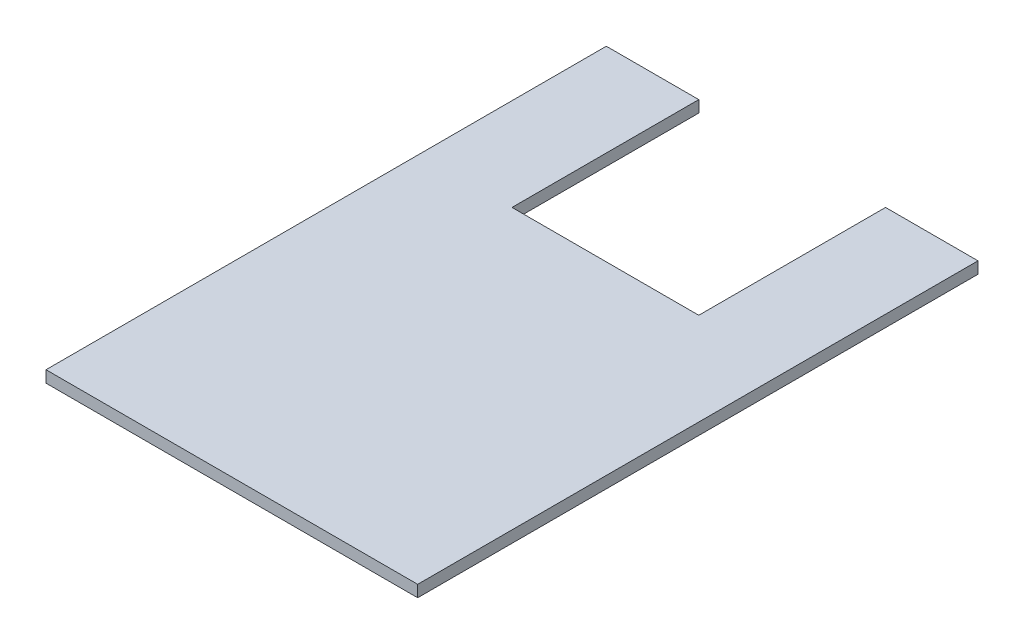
ISO-10303-21;
HEADER;
FILE_DESCRIPTION(('STEP AP214'),'2;1');
FILE_NAME('part.step','',(''),(''),'','','');
FILE_SCHEMA(('AUTOMOTIVE_DESIGN { 1 0 10303 214 1 1 1 1 }'));
ENDSEC;
DATA;
#1=APPLICATION_CONTEXT('core data for automotive mechanical design processes');
#2=APPLICATION_PROTOCOL_DEFINITION('international standard','automotive_design',2000,#1);
#3=PRODUCT_CONTEXT('',#1,'mechanical');
#4=PRODUCT('Part','Part','',(#3));
#5=PRODUCT_RELATED_PRODUCT_CATEGORY('part','',(#4));
#6=PRODUCT_DEFINITION_FORMATION('','',#4);
#7=PRODUCT_DEFINITION_CONTEXT('part definition',#1,'design');
#8=PRODUCT_DEFINITION('design','',#6,#7);
#9=PRODUCT_DEFINITION_SHAPE('','',#8);
#10=(LENGTH_UNIT() NAMED_UNIT(*) SI_UNIT(.MILLI.,.METRE.));
#11=(NAMED_UNIT(*) PLANE_ANGLE_UNIT() SI_UNIT($,.RADIAN.));
#12=(NAMED_UNIT(*) SI_UNIT($,.STERADIAN.) SOLID_ANGLE_UNIT());
#13=UNCERTAINTY_MEASURE_WITH_UNIT(LENGTH_MEASURE(1.E-05),#10,'distance_accuracy_value','');
#14=(GEOMETRIC_REPRESENTATION_CONTEXT(3) GLOBAL_UNCERTAINTY_ASSIGNED_CONTEXT((#13)) GLOBAL_UNIT_ASSIGNED_CONTEXT((#10,
#11,#12)) REPRESENTATION_CONTEXT('',''));
#15=CARTESIAN_POINT('',(0.,0.,0.));
#16=DIRECTION('',(0.,0.,1.));
#17=DIRECTION('',(1.,0.,0.));
#18=AXIS2_PLACEMENT_3D('',#15,#16,#17);
#19=CARTESIAN_POINT('',(0.,0.,0.));
#20=DIRECTION('',(0.,0.,-1.));
#21=DIRECTION('',(-1.,0.,0.));
#22=AXIS2_PLACEMENT_3D('',#19,#20,#21);
#23=PLANE('',#22);
#24=DIRECTION('',(0.,-1.,0.));
#25=VECTOR('',#24,1.);
#26=CARTESIAN_POINT('',(-25.4,-17.8848333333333,0.));
#27=LINE('',#26,#25);
#28=CARTESIAN_POINT('',(-25.4,-17.8858333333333,0.));
#29=VERTEX_POINT('',#28);
#30=CARTESIAN_POINT('',(-25.4,-21.0608333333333,0.));
#31=VERTEX_POINT('',#30);
#32=EDGE_CURVE('E107',#29,#31,#27,.T.);
#33=ORIENTED_EDGE('',*,*,#32,.T.);
#34=DIRECTION('',(1.,0.,0.));
#35=VECTOR('',#34,1.);
#36=CARTESIAN_POINT('',(-50.546,-21.0608333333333,0.));
#37=LINE('',#36,#35);
#38=CARTESIAN_POINT('',(-50.546,-21.0608333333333,0.));
#39=VERTEX_POINT('',#38);
#40=EDGE_CURVE('E130',#39,#31,#37,.T.);
#41=ORIENTED_EDGE('',*,*,#40,.F.);
#42=DIRECTION('',(0.,-1.,0.));
#43=VECTOR('',#42,1.);
#44=CARTESIAN_POINT('',(-50.546,-21.0608333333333,0.));
#45=LINE('',#44,#43);
#46=CARTESIAN_POINT('',(-50.546,-17.8858333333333,0.));
#47=VERTEX_POINT('',#46);
#48=EDGE_CURVE('E124',#47,#39,#45,.T.);
#49=ORIENTED_EDGE('',*,*,#48,.F.);
#50=DIRECTION('',(-1.,0.,0.));
#51=VECTOR('',#50,1.);
#52=CARTESIAN_POINT('',(-50.546,-17.8858333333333,0.));
#53=LINE('',#52,#51);
#54=EDGE_CURVE('E78',#29,#47,#53,.T.);
#55=ORIENTED_EDGE('',*,*,#54,.F.);
#56=EDGE_LOOP('',(#33,#41,#49,#55));
#57=FACE_BOUND('',#56,.T.);
#58=ADVANCED_FACE('F33',(#57),#23,.T.);
#59=CARTESIAN_POINT('',(-50.546,-21.0608333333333,152.4));
#60=DIRECTION('',(1.,0.,0.));
#61=DIRECTION('',(0.,0.,-1.));
#62=AXIS2_PLACEMENT_3D('',#59,#60,#61);
#63=PLANE('',#62);
#64=ORIENTED_EDGE('',*,*,#48,.T.);
#65=DIRECTION('',(0.,0.,-1.));
#66=VECTOR('',#65,1.);
#67=CARTESIAN_POINT('',(-50.546,-21.0608333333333,152.4));
#68=LINE('',#67,#66);
#69=CARTESIAN_POINT('',(-50.546,-21.0608333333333,152.4));
#70=VERTEX_POINT('',#69);
#71=EDGE_CURVE('E11',#70,#39,#68,.T.);
#72=ORIENTED_EDGE('',*,*,#71,.F.);
#73=DIRECTION('',(0.,-1.,0.));
#74=VECTOR('',#73,1.);
#75=CARTESIAN_POINT('',(-50.546,-21.0608333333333,152.4));
#76=LINE('',#75,#74);
#77=CARTESIAN_POINT('',(-50.546,-17.8858333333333,152.4));
#78=VERTEX_POINT('',#77);
#79=EDGE_CURVE('E129',#78,#70,#76,.T.);
#80=ORIENTED_EDGE('',*,*,#79,.F.);
#81=DIRECTION('',(0.,0.,-1.));
#82=VECTOR('',#81,1.);
#83=CARTESIAN_POINT('',(-50.546,-17.8858333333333,152.4));
#84=LINE('',#83,#82);
#85=EDGE_CURVE('E134',#78,#47,#84,.T.);
#86=ORIENTED_EDGE('',*,*,#85,.T.);
#87=EDGE_LOOP('',(#64,#72,#80,#86));
#88=FACE_BOUND('',#87,.T.);
#89=ADVANCED_FACE('F35',(#88),#63,.F.);
#90=CARTESIAN_POINT('',(-50.546,-21.0608333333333,152.4));
#91=DIRECTION('',(0.,1.,0.));
#92=DIRECTION('',(0.,0.,1.));
#93=AXIS2_PLACEMENT_3D('',#90,#91,#92);
#94=PLANE('',#93);
#95=ORIENTED_EDGE('',*,*,#40,.T.);
#96=DIRECTION('',(0.,0.,-1.));
#97=VECTOR('',#96,1.);
#98=CARTESIAN_POINT('',(-25.4,-21.0608333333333,0.));
#99=LINE('',#98,#97);
#100=CARTESIAN_POINT('',(-25.4,-21.0608333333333,50.8));
#101=VERTEX_POINT('',#100);
#102=EDGE_CURVE('E112',#101,#31,#99,.T.);
#103=ORIENTED_EDGE('',*,*,#102,.F.);
#104=DIRECTION('',(-1.,0.,0.));
#105=VECTOR('',#104,1.);
#106=CARTESIAN_POINT('',(-25.4,-21.0608333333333,50.8));
#107=LINE('',#106,#105);
#108=CARTESIAN_POINT('',(25.4,-21.0608333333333,50.8));
#109=VERTEX_POINT('',#108);
#110=EDGE_CURVE('E116',#109,#101,#107,.T.);
#111=ORIENTED_EDGE('',*,*,#110,.F.);
#112=DIRECTION('',(0.,0.,1.));
#113=VECTOR('',#112,1.);
#114=CARTESIAN_POINT('',(25.4,-21.0608333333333,0.));
#115=LINE('',#114,#113);
#116=CARTESIAN_POINT('',(25.4,-21.0608333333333,0.));
#117=VERTEX_POINT('',#116);
#118=EDGE_CURVE('E160',#117,#109,#115,.T.);
#119=ORIENTED_EDGE('',*,*,#118,.F.);
#120=CARTESIAN_POINT('',(50.546,-21.0608333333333,0.));
#121=VERTEX_POINT('',#120);
#122=EDGE_CURVE('E149',#117,#121,#37,.T.);
#123=ORIENTED_EDGE('',*,*,#122,.T.);
#124=DIRECTION('',(0.,0.,-1.));
#125=VECTOR('',#124,1.);
#126=CARTESIAN_POINT('',(50.546,-21.0608333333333,152.4));
#127=LINE('',#126,#125);
#128=CARTESIAN_POINT('',(50.546,-21.0608333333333,152.4));
#129=VERTEX_POINT('',#128);
#130=EDGE_CURVE('E41',#129,#121,#127,.T.);
#131=ORIENTED_EDGE('',*,*,#130,.F.);
#132=DIRECTION('',(1.,0.,0.));
#133=VECTOR('',#132,1.);
#134=CARTESIAN_POINT('',(-50.546,-21.0608333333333,152.4));
#135=LINE('',#134,#133);
#136=EDGE_CURVE('E85',#70,#129,#135,.T.);
#137=ORIENTED_EDGE('',*,*,#136,.F.);
#138=ORIENTED_EDGE('',*,*,#71,.T.);
#139=EDGE_LOOP('',(#95,#103,#111,#119,#123,#131,#137,#138));
#140=FACE_BOUND('',#139,.T.);
#141=ADVANCED_FACE('F157',(#140),#94,.F.);
#142=CARTESIAN_POINT('',(50.546,-21.0608333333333,152.4));
#143=DIRECTION('',(-1.,0.,0.));
#144=DIRECTION('',(0.,0.,1.));
#145=AXIS2_PLACEMENT_3D('',#142,#143,#144);
#146=PLANE('',#145);
#147=DIRECTION('',(0.,1.,0.));
#148=VECTOR('',#147,1.);
#149=CARTESIAN_POINT('',(50.546,-21.0608333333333,0.));
#150=LINE('',#149,#148);
#151=CARTESIAN_POINT('',(50.546,-17.8858333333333,0.));
#152=VERTEX_POINT('',#151);
#153=EDGE_CURVE('E126',#121,#152,#150,.T.);
#154=ORIENTED_EDGE('',*,*,#153,.T.);
#155=DIRECTION('',(0.,0.,-1.));
#156=VECTOR('',#155,1.);
#157=CARTESIAN_POINT('',(50.546,-17.8858333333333,152.4));
#158=LINE('',#157,#156);
#159=CARTESIAN_POINT('',(50.546,-17.8858333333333,152.4));
#160=VERTEX_POINT('',#159);
#161=EDGE_CURVE('E136',#160,#152,#158,.T.);
#162=ORIENTED_EDGE('',*,*,#161,.F.);
#163=DIRECTION('',(0.,1.,0.));
#164=VECTOR('',#163,1.);
#165=CARTESIAN_POINT('',(50.546,-21.0608333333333,152.4));
#166=LINE('',#165,#164);
#167=EDGE_CURVE('E144',#129,#160,#166,.T.);
#168=ORIENTED_EDGE('',*,*,#167,.F.);
#169=ORIENTED_EDGE('',*,*,#130,.T.);
#170=EDGE_LOOP('',(#154,#162,#168,#169));
#171=FACE_BOUND('',#170,.T.);
#172=ADVANCED_FACE('F142',(#171),#146,.F.);
#173=CARTESIAN_POINT('',(-50.546,-17.8858333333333,152.4));
#174=DIRECTION('',(0.,-1.,0.));
#175=DIRECTION('',(0.,0.,-1.));
#176=AXIS2_PLACEMENT_3D('',#173,#174,#175);
#177=PLANE('',#176);
#178=DIRECTION('',(1.,0.,0.));
#179=VECTOR('',#178,1.);
#180=CARTESIAN_POINT('',(-25.4,-17.8858333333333,50.8));
#181=LINE('',#180,#179);
#182=CARTESIAN_POINT('',(-25.4,-17.8858333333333,50.8));
#183=VERTEX_POINT('',#182);
#184=CARTESIAN_POINT('',(25.4,-17.8858333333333,50.8));
#185=VERTEX_POINT('',#184);
#186=EDGE_CURVE('E120',#183,#185,#181,.T.);
#187=ORIENTED_EDGE('',*,*,#186,.F.);
#188=DIRECTION('',(0.,0.,1.));
#189=VECTOR('',#188,1.);
#190=CARTESIAN_POINT('',(-25.4,-17.8858333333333,0.));
#191=LINE('',#190,#189);
#192=EDGE_CURVE('E109',#29,#183,#191,.T.);
#193=ORIENTED_EDGE('',*,*,#192,.F.);
#194=ORIENTED_EDGE('',*,*,#54,.T.);
#195=ORIENTED_EDGE('',*,*,#85,.F.);
#196=DIRECTION('',(-1.,0.,0.));
#197=VECTOR('',#196,1.);
#198=CARTESIAN_POINT('',(-50.546,-17.8858333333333,152.4));
#199=LINE('',#198,#197);
#200=EDGE_CURVE('E57',#160,#78,#199,.T.);
#201=ORIENTED_EDGE('',*,*,#200,.F.);
#202=ORIENTED_EDGE('',*,*,#161,.T.);
#203=CARTESIAN_POINT('',(25.4,-17.8858333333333,0.));
#204=VERTEX_POINT('',#203);
#205=EDGE_CURVE('E125',#152,#204,#53,.T.);
#206=ORIENTED_EDGE('',*,*,#205,.T.);
#207=DIRECTION('',(0.,0.,-1.));
#208=VECTOR('',#207,1.);
#209=CARTESIAN_POINT('',(25.4,-17.8858333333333,0.));
#210=LINE('',#209,#208);
#211=EDGE_CURVE('E48',#185,#204,#210,.T.);
#212=ORIENTED_EDGE('',*,*,#211,.F.);
#213=EDGE_LOOP('',(#187,#193,#194,#195,#201,#202,#206,#212));
#214=FACE_BOUND('',#213,.T.);
#215=ADVANCED_FACE('F118',(#214),#177,.F.);
#216=CARTESIAN_POINT('',(0.,0.,152.4));
#217=DIRECTION('',(0.,0.,-1.));
#218=DIRECTION('',(-1.,0.,0.));
#219=AXIS2_PLACEMENT_3D('',#216,#217,#218);
#220=PLANE('',#219);
#221=ORIENTED_EDGE('',*,*,#79,.T.);
#222=ORIENTED_EDGE('',*,*,#136,.T.);
#223=ORIENTED_EDGE('',*,*,#167,.T.);
#224=ORIENTED_EDGE('',*,*,#200,.T.);
#225=EDGE_LOOP('',(#221,#222,#223,#224));
#226=FACE_BOUND('',#225,.T.);
#227=ADVANCED_FACE('F170',(#226),#220,.F.);
#228=DIRECTION('',(0.,-1.,0.));
#229=VECTOR('',#228,1.);
#230=CARTESIAN_POINT('',(25.4,-17.8848333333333,0.));
#231=LINE('',#230,#229);
#232=EDGE_CURVE('E115',#204,#117,#231,.T.);
#233=ORIENTED_EDGE('',*,*,#232,.F.);
#234=ORIENTED_EDGE('',*,*,#205,.F.);
#235=ORIENTED_EDGE('',*,*,#153,.F.);
#236=ORIENTED_EDGE('',*,*,#122,.F.);
#237=EDGE_LOOP('',(#233,#234,#235,#236));
#238=FACE_BOUND('',#237,.T.);
#239=ADVANCED_FACE('F148',(#238),#23,.T.);
#240=CARTESIAN_POINT('',(-25.4,-17.8848333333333,0.));
#241=DIRECTION('',(-1.,0.,0.));
#242=DIRECTION('',(0.,0.,1.));
#243=AXIS2_PLACEMENT_3D('',#240,#241,#242);
#244=PLANE('',#243);
#245=ORIENTED_EDGE('',*,*,#192,.T.);
#246=DIRECTION('',(0.,-1.,0.));
#247=VECTOR('',#246,1.);
#248=CARTESIAN_POINT('',(-25.4,-17.8848333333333,50.8));
#249=LINE('',#248,#247);
#250=EDGE_CURVE('E155',#183,#101,#249,.T.);
#251=ORIENTED_EDGE('',*,*,#250,.T.);
#252=ORIENTED_EDGE('',*,*,#102,.T.);
#253=ORIENTED_EDGE('',*,*,#32,.F.);
#254=EDGE_LOOP('',(#245,#251,#252,#253));
#255=FACE_BOUND('',#254,.T.);
#256=ADVANCED_FACE('F108',(#255),#244,.F.);
#257=CARTESIAN_POINT('',(-25.4,-17.8848333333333,50.8));
#258=DIRECTION('',(0.,0.,1.));
#259=DIRECTION('',(1.,0.,0.));
#260=AXIS2_PLACEMENT_3D('',#257,#258,#259);
#261=PLANE('',#260);
#262=ORIENTED_EDGE('',*,*,#186,.T.);
#263=DIRECTION('',(0.,-1.,0.));
#264=VECTOR('',#263,1.);
#265=CARTESIAN_POINT('',(25.4,-17.8848333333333,50.8));
#266=LINE('',#265,#264);
#267=EDGE_CURVE('E167',#185,#109,#266,.T.);
#268=ORIENTED_EDGE('',*,*,#267,.T.);
#269=ORIENTED_EDGE('',*,*,#110,.T.);
#270=ORIENTED_EDGE('',*,*,#250,.F.);
#271=EDGE_LOOP('',(#262,#268,#269,#270));
#272=FACE_BOUND('',#271,.T.);
#273=ADVANCED_FACE('F188',(#272),#261,.F.);
#274=CARTESIAN_POINT('',(25.4,-17.8848333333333,0.));
#275=DIRECTION('',(1.,0.,0.));
#276=DIRECTION('',(0.,0.,-1.));
#277=AXIS2_PLACEMENT_3D('',#274,#275,#276);
#278=PLANE('',#277);
#279=ORIENTED_EDGE('',*,*,#211,.T.);
#280=ORIENTED_EDGE('',*,*,#232,.T.);
#281=ORIENTED_EDGE('',*,*,#118,.T.);
#282=ORIENTED_EDGE('',*,*,#267,.F.);
#283=EDGE_LOOP('',(#279,#280,#281,#282));
#284=FACE_BOUND('',#283,.T.);
#285=ADVANCED_FACE('F194',(#284),#278,.F.);
#286=CLOSED_SHELL('',(#58,#89,#141,#172,#215,#227,#239,#256,#273,#285));
#287=MANIFOLD_SOLID_BREP('B2',#286);
#288=ADVANCED_BREP_SHAPE_REPRESENTATION('',(#18,#287),#14);
#289=SHAPE_DEFINITION_REPRESENTATION(#9,#288);
ENDSEC;
END-ISO-10303-21;
